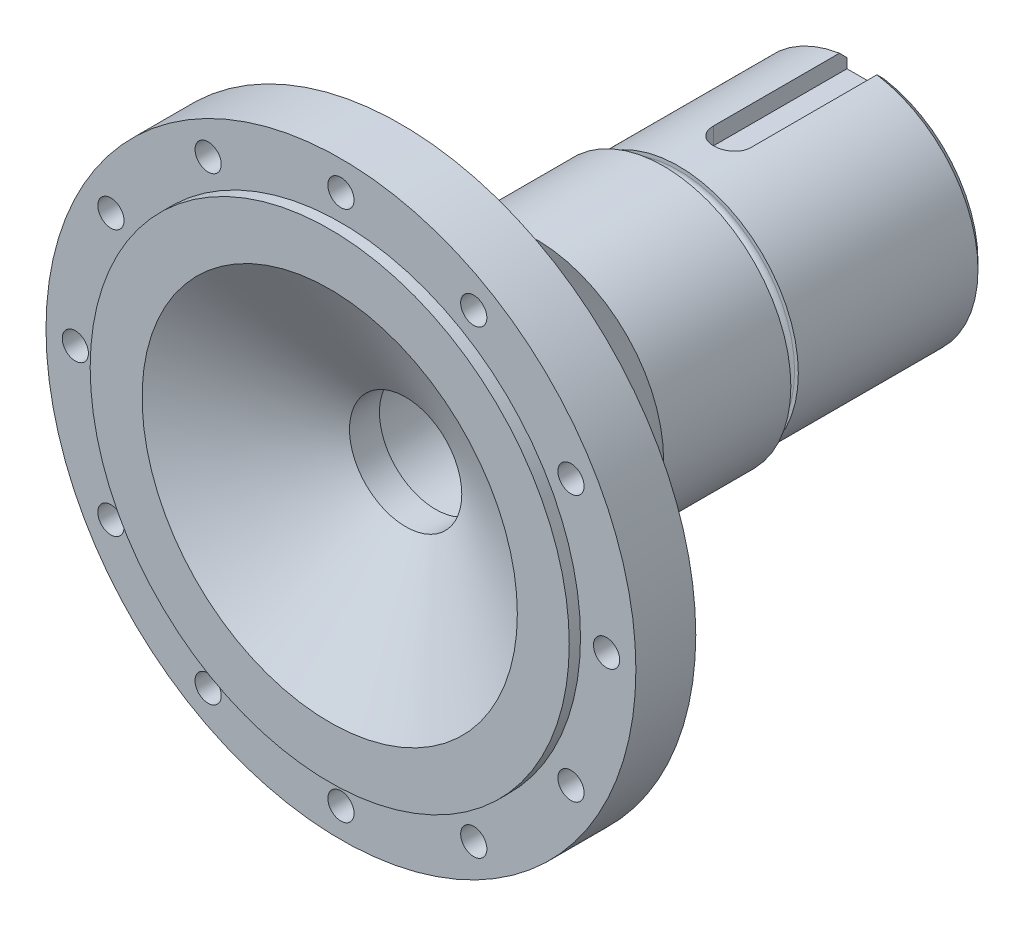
ISO-10303-21;
HEADER;
FILE_DESCRIPTION(('STEP AP214'),'2;1');
FILE_NAME('part.step','',(''),(''),'','','');
FILE_SCHEMA(('AUTOMOTIVE_DESIGN { 1 0 10303 214 1 1 1 1 }'));
ENDSEC;
DATA;
#1=APPLICATION_CONTEXT('core data for automotive mechanical design processes');
#2=APPLICATION_PROTOCOL_DEFINITION('international standard','automotive_design',2000,#1);
#3=PRODUCT_CONTEXT('',#1,'mechanical');
#4=PRODUCT('Part','Part','',(#3));
#5=PRODUCT_RELATED_PRODUCT_CATEGORY('part','',(#4));
#6=PRODUCT_DEFINITION_FORMATION('','',#4);
#7=PRODUCT_DEFINITION_CONTEXT('part definition',#1,'design');
#8=PRODUCT_DEFINITION('design','',#6,#7);
#9=PRODUCT_DEFINITION_SHAPE('','',#8);
#10=(LENGTH_UNIT() NAMED_UNIT(*) SI_UNIT(.MILLI.,.METRE.));
#11=(NAMED_UNIT(*) PLANE_ANGLE_UNIT() SI_UNIT($,.RADIAN.));
#12=(NAMED_UNIT(*) SI_UNIT($,.STERADIAN.) SOLID_ANGLE_UNIT());
#13=UNCERTAINTY_MEASURE_WITH_UNIT(LENGTH_MEASURE(1.E-05),#10,'distance_accuracy_value','');
#14=(GEOMETRIC_REPRESENTATION_CONTEXT(3) GLOBAL_UNCERTAINTY_ASSIGNED_CONTEXT((#13)) GLOBAL_UNIT_ASSIGNED_CONTEXT((#10,
#11,#12)) REPRESENTATION_CONTEXT('',''));
#15=CARTESIAN_POINT('',(0.,0.,0.));
#16=DIRECTION('',(0.,0.,1.));
#17=DIRECTION('',(1.,0.,0.));
#18=AXIS2_PLACEMENT_3D('',#15,#16,#17);
#19=CARTESIAN_POINT('',(0.,8.03891519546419,-72.3457304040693));
#20=DIRECTION('',(0.,0.,1.));
#21=DIRECTION('',(1.,0.,0.));
#22=AXIS2_PLACEMENT_3D('',#19,#20,#21);
#23=PLANE('',#22);
#24=CARTESIAN_POINT('',(0.,0.,-72.3457304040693));
#25=DIRECTION('',(0.,0.,1.));
#26=DIRECTION('',(1.,0.,0.));
#27=AXIS2_PLACEMENT_3D('',#24,#25,#26);
#28=CIRCLE('',#27,12.5);
#29=CARTESIAN_POINT('',(12.5,0.,-72.3457304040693));
#30=VERTEX_POINT('',#29);
#31=EDGE_CURVE('E167',#30,#30,#28,.T.);
#32=ORIENTED_EDGE('',*,*,#31,.T.);
#33=EDGE_LOOP('',(#32));
#34=FACE_BOUND('',#33,.T.);
#35=DIRECTION('',(0.,-1.,0.));
#36=VECTOR('',#35,1.);
#37=CARTESIAN_POINT('',(2.50000000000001,8.03891519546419,-72.3457304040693));
#38=LINE('',#37,#36);
#39=CARTESIAN_POINT('',(2.50000000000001,14.7901994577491,-72.3457304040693));
#40=VERTEX_POINT('',#39);
#41=CARTESIAN_POINT('',(2.50000000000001,13.5,-72.3457304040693));
#42=VERTEX_POINT('',#41);
#43=EDGE_CURVE('E93',#40,#42,#38,.T.);
#44=ORIENTED_EDGE('',*,*,#43,.F.);
#45=CARTESIAN_POINT('',(0.,0.,-72.3457304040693));
#46=DIRECTION('',(0.,0.,1.));
#47=DIRECTION('',(1.,0.,0.));
#48=AXIS2_PLACEMENT_3D('',#45,#46,#47);
#49=CIRCLE('',#48,15.);
#50=CARTESIAN_POINT('',(-2.50000000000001,14.7901994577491,-72.3457304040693));
#51=VERTEX_POINT('',#50);
#52=EDGE_CURVE('E40',#40,#51,#49,.F.);
#53=ORIENTED_EDGE('',*,*,#52,.T.);
#54=DIRECTION('',(0.,1.,0.));
#55=VECTOR('',#54,1.);
#56=CARTESIAN_POINT('',(-2.50000000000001,8.03891519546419,-72.3457304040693));
#57=LINE('',#56,#55);
#58=CARTESIAN_POINT('',(-2.50000000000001,13.5,-72.3457304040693));
#59=VERTEX_POINT('',#58);
#60=EDGE_CURVE('E87',#59,#51,#57,.T.);
#61=ORIENTED_EDGE('',*,*,#60,.F.);
#62=DIRECTION('',(-1.,0.,0.));
#63=VECTOR('',#62,1.);
#64=CARTESIAN_POINT('',(0.,13.5,-72.3457304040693));
#65=LINE('',#64,#63);
#66=EDGE_CURVE('E576',#42,#59,#65,.T.);
#67=ORIENTED_EDGE('',*,*,#66,.F.);
#68=EDGE_LOOP('',(#44,#53,#61,#67));
#69=FACE_BOUND('',#68,.T.);
#70=ADVANCED_FACE('F27',(#34,#69),#23,.F.);
#71=CARTESIAN_POINT('',(0.,0.,61.8175968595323));
#72=DIRECTION('',(0.,0.,1.));
#73=DIRECTION('',(1.,0.,0.));
#74=AXIS2_PLACEMENT_3D('',#71,#72,#73);
#75=CYLINDRICAL_SURFACE('',#74,16.);
#76=CARTESIAN_POINT('',(0.,0.,-47.3457304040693));
#77=DIRECTION('',(0.,0.,1.));
#78=DIRECTION('',(1.,0.,0.));
#79=AXIS2_PLACEMENT_3D('',#76,#77,#78);
#80=CIRCLE('',#79,16.);
#81=CARTESIAN_POINT('',(16.,0.,-47.3457304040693));
#82=VERTEX_POINT('',#81);
#83=EDGE_CURVE('E164',#82,#82,#80,.T.);
#84=ORIENTED_EDGE('',*,*,#83,.F.);
#85=EDGE_LOOP('',(#84));
#86=FACE_BOUND('',#85,.T.);
#87=DIRECTION('',(0.,0.,1.));
#88=VECTOR('',#87,1.);
#89=CARTESIAN_POINT('',(-2.50000000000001,15.8034806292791,61.8175968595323));
#90=LINE('',#89,#88);
#91=CARTESIAN_POINT('',(-2.50000000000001,15.8034806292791,-54.510874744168));
#92=VERTEX_POINT('',#91);
#93=CARTESIAN_POINT('',(-2.50000000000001,15.8034806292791,-71.3457304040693));
#94=VERTEX_POINT('',#93);
#95=EDGE_CURVE('E215',#92,#94,#90,.F.);
#96=ORIENTED_EDGE('',*,*,#95,.T.);
#97=CARTESIAN_POINT('',(0.,0.,-71.3457304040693));
#98=DIRECTION('',(0.,0.,1.));
#99=DIRECTION('',(1.,0.,0.));
#100=AXIS2_PLACEMENT_3D('',#97,#98,#99);
#101=CIRCLE('',#100,16.);
#102=CARTESIAN_POINT('',(2.50000000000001,15.8034806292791,-71.3457304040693));
#103=VERTEX_POINT('',#102);
#104=EDGE_CURVE('E574',#94,#103,#101,.T.);
#105=ORIENTED_EDGE('',*,*,#104,.T.);
#106=DIRECTION('',(0.,0.,1.));
#107=VECTOR('',#106,1.);
#108=CARTESIAN_POINT('',(2.50000000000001,15.8034806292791,61.8175968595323));
#109=LINE('',#108,#107);
#110=CARTESIAN_POINT('',(2.50000000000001,15.8034806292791,-54.510874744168));
#111=VERTEX_POINT('',#110);
#112=EDGE_CURVE('E248',#103,#111,#109,.T.);
#113=ORIENTED_EDGE('',*,*,#112,.T.);
#114=CARTESIAN_POINT('',(2.50000000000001,15.8034806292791,-54.510874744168));
#115=CARTESIAN_POINT('',(2.5000072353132,15.80347600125,-54.4410171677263));
#116=CARTESIAN_POINT('',(2.49707201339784,15.8039437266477,-54.3711633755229));
#117=CARTESIAN_POINT('',(2.48537272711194,15.8057896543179,-54.2319640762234));
#118=CARTESIAN_POINT('',(2.47660920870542,15.8071677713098,-54.1626185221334));
#119=CARTESIAN_POINT('',(2.45332339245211,15.8107980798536,-54.0250059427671));
#120=CARTESIAN_POINT('',(2.4388080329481,15.813049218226,-53.9567377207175));
#121=CARTESIAN_POINT('',(2.40414286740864,15.8183564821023,-53.8216990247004));
#122=CARTESIAN_POINT('',(2.38399307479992,15.8214126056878,-53.7549285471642));
#123=CARTESIAN_POINT('',(2.31527776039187,15.831666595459,-53.557534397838));
#124=CARTESIAN_POINT('',(2.25843113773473,15.8399525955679,-53.4297390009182));
#125=CARTESIAN_POINT('',(2.12438158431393,15.8584851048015,-53.1855706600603));
#126=CARTESIAN_POINT('',(2.04717889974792,15.8687315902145,-53.0691975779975));
#127=CARTESIAN_POINT('',(1.87388294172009,15.8901297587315,-52.8500891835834));
#128=CARTESIAN_POINT('',(1.77764958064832,15.9012877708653,-52.7474650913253));
#129=CARTESIAN_POINT('',(1.56932125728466,15.9231962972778,-52.5597472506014));
#130=CARTESIAN_POINT('',(1.45722387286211,15.9339467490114,-52.4746561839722));
#131=CARTESIAN_POINT('',(1.21963095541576,15.9538949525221,-52.3240080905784));
#132=CARTESIAN_POINT('',(1.09406870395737,15.9630843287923,-52.2585550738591));
#133=CARTESIAN_POINT('',(0.833572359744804,15.978803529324,-52.149714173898));
#134=CARTESIAN_POINT('',(0.698639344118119,15.9853336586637,-52.1063237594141));
#135=CARTESIAN_POINT('',(0.424386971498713,15.9949542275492,-52.0431764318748));
#136=CARTESIAN_POINT('',(0.285112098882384,15.9980721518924,-52.0232305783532));
#137=CARTESIAN_POINT('',(0.00515650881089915,16.0006113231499,-52.0069516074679));
#138=CARTESIAN_POINT('',(-0.135524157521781,16.0000327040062,-52.0106176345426));
#139=CARTESIAN_POINT('',(-0.413000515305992,15.9952657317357,-52.0413107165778));
#140=CARTESIAN_POINT('',(-0.549819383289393,15.9911088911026,-52.0681338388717));
#141=CARTESIAN_POINT('',(-0.816989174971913,15.9796876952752,-52.1440590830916));
#142=CARTESIAN_POINT('',(-0.947339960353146,15.9724232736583,-52.1931616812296));
#143=CARTESIAN_POINT('',(-1.19848985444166,15.9555490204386,-52.3124595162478));
#144=CARTESIAN_POINT('',(-1.31924765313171,15.9459297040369,-52.3827403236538));
#145=CARTESIAN_POINT('',(-1.54732802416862,15.9254170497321,-52.5423344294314));
#146=CARTESIAN_POINT('',(-1.6546501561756,15.9145236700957,-52.6316483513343));
#147=CARTESIAN_POINT('',(-1.85400788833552,15.8925403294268,-52.8278938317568));
#148=CARTESIAN_POINT('',(-1.94587033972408,15.8814495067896,-52.9350012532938));
#149=CARTESIAN_POINT('',(-2.11037188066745,15.8604297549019,-53.1632402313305));
#150=CARTESIAN_POINT('',(-2.18300543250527,15.850501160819,-53.2843758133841));
#151=CARTESIAN_POINT('',(-2.30701457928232,15.8329285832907,-53.5374372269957));
#152=CARTESIAN_POINT('',(-2.35835878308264,15.82528797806,-53.6693786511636));
#153=CARTESIAN_POINT('',(-2.43803542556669,15.8132107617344,-53.9400667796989));
#154=CARTESIAN_POINT('',(-2.46640232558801,15.8087693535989,-54.0788029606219));
#155=CARTESIAN_POINT('',(-2.48858763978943,15.8052822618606,-54.2672947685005));
#156=CARTESIAN_POINT('',(-2.4928691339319,15.8046072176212,-54.3159530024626));
#157=CARTESIAN_POINT('',(-2.49857155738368,15.8037068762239,-54.4133587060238));
#158=CARTESIAN_POINT('',(-2.49999729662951,15.8034808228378,-54.4621058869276));
#159=CARTESIAN_POINT('',(-2.50000000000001,15.8034806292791,-54.510874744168));
#160=B_SPLINE_CURVE_WITH_KNOTS('',3,(#114,#115,#116,#117,#118,#119,#120,#121,#122,#123,#124,
#125,#126,#127,#128,#129,#130,#131,#132,#133,#134,#135,#136,#137,#138,#139,#140,#141,#142,#143,
#144,#145,#146,#147,#148,#149,#150,#151,#152,#153,#154,#155,#156,#157,#158,#159),.UNSPECIFIED.,
.F.,.F.,(4,2,2,2,2,2,2,2,2,2,2,2,2,2,2,2,2,2,2,2,2,2,4),(0.,0.209502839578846,0.41898605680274,
0.628217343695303,0.837448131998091,1.25564214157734,1.67383109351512,2.09522137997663,
2.51667607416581,2.94032506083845,3.36392543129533,3.78408806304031,4.20423547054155,
4.62072016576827,5.0372137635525,5.45541329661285,5.87362653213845,6.29625026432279,
6.71899557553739,7.14236202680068,7.56509233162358,7.71158120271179,7.85782313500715),.UNSPECIFIED.);
#161=EDGE_CURVE('E86',#111,#92,#160,.T.);
#162=ORIENTED_EDGE('',*,*,#161,.T.);
#163=EDGE_LOOP('',(#96,#105,#113,#162));
#164=FACE_BOUND('',#163,.T.);
#165=ADVANCED_FACE('F250',(#86,#164),#75,.T.);
#166=CARTESIAN_POINT('',(0.,0.,61.8175968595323));
#167=DIRECTION('',(0.,0.,1.));
#168=DIRECTION('',(1.,0.,0.));
#169=AXIS2_PLACEMENT_3D('',#166,#167,#168);
#170=CYLINDRICAL_SURFACE('',#169,17.);
#171=CARTESIAN_POINT('',(0.,0.,-45.3457304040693));
#172=DIRECTION('',(0.,0.,1.));
#173=DIRECTION('',(1.,0.,0.));
#174=AXIS2_PLACEMENT_3D('',#171,#172,#173);
#175=CIRCLE('',#174,17.);
#176=CARTESIAN_POINT('',(17.,0.,-45.3457304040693));
#177=VERTEX_POINT('',#176);
#178=EDGE_CURVE('E155',#177,#177,#175,.T.);
#179=ORIENTED_EDGE('',*,*,#178,.T.);
#180=EDGE_LOOP('',(#179));
#181=FACE_BOUND('',#180,.T.);
#182=CARTESIAN_POINT('',(0.,0.,-28.3457304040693));
#183=DIRECTION('',(0.,0.,1.));
#184=DIRECTION('',(1.,0.,0.));
#185=AXIS2_PLACEMENT_3D('',#182,#183,#184);
#186=CIRCLE('',#185,17.);
#187=CARTESIAN_POINT('',(17.,0.,-28.3457304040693));
#188=VERTEX_POINT('',#187);
#189=EDGE_CURVE('E212',#188,#188,#186,.T.);
#190=ORIENTED_EDGE('',*,*,#189,.F.);
#191=EDGE_LOOP('',(#190));
#192=FACE_BOUND('',#191,.T.);
#193=ADVANCED_FACE('F29',(#181,#192),#170,.T.);
#194=CARTESIAN_POINT('',(0.,0.,-16.7457304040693));
#195=DIRECTION('',(0.,0.,1.));
#196=DIRECTION('',(1.,0.,0.));
#197=AXIS2_PLACEMENT_3D('',#194,#195,#196);
#198=CONICAL_SURFACE('',#197,26.7335557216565,0.698131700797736);
#199=ORIENTED_EDGE('',*,*,#189,.T.);
#200=EDGE_LOOP('',(#199));
#201=FACE_BOUND('',#200,.T.);
#202=CARTESIAN_POINT('',(0.,0.,-16.7457304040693));
#203=DIRECTION('',(0.,0.,1.));
#204=DIRECTION('',(1.,0.,0.));
#205=AXIS2_PLACEMENT_3D('',#202,#203,#204);
#206=CIRCLE('',#205,26.7335557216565);
#207=CARTESIAN_POINT('',(26.7335557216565,0.,-16.7457304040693));
#208=VERTEX_POINT('',#207);
#209=EDGE_CURVE('E209',#208,#208,#206,.T.);
#210=ORIENTED_EDGE('',*,*,#209,.F.);
#211=EDGE_LOOP('',(#210));
#212=FACE_BOUND('',#211,.T.);
#213=ADVANCED_FACE('F383',(#201,#212),#198,.T.);
#214=CARTESIAN_POINT('',(0.,8.03891519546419,-16.7457304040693));
#215=DIRECTION('',(0.,0.,1.));
#216=DIRECTION('',(1.,0.,0.));
#217=AXIS2_PLACEMENT_3D('',#214,#215,#216);
#218=PLANE('',#217);
#219=CARTESIAN_POINT('',(0.,0.,-16.7457304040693));
#220=DIRECTION('',(0.,0.,1.));
#221=DIRECTION('',(1.,0.,0.));
#222=AXIS2_PLACEMENT_3D('',#219,#220,#221);
#223=CIRCLE('',#222,28.);
#224=CARTESIAN_POINT('',(28.,0.,-16.7457304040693));
#225=VERTEX_POINT('',#224);
#226=EDGE_CURVE('E206',#225,#225,#223,.T.);
#227=ORIENTED_EDGE('',*,*,#226,.F.);
#228=EDGE_LOOP('',(#227));
#229=FACE_BOUND('',#228,.T.);
#230=ORIENTED_EDGE('',*,*,#209,.T.);
#231=EDGE_LOOP('',(#230));
#232=FACE_BOUND('',#231,.T.);
#233=ADVANCED_FACE('F380',(#229,#232),#218,.F.);
#234=CARTESIAN_POINT('',(0.,0.,61.8175968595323));
#235=DIRECTION('',(0.,0.,1.));
#236=DIRECTION('',(1.,0.,0.));
#237=AXIS2_PLACEMENT_3D('',#234,#235,#236);
#238=CYLINDRICAL_SURFACE('',#237,28.);
#239=ORIENTED_EDGE('',*,*,#226,.T.);
#240=EDGE_LOOP('',(#239));
#241=FACE_BOUND('',#240,.T.);
#242=CARTESIAN_POINT('',(0.,0.,-10.2457304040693));
#243=DIRECTION('',(0.,0.,1.));
#244=DIRECTION('',(1.,0.,0.));
#245=AXIS2_PLACEMENT_3D('',#242,#243,#244);
#246=CIRCLE('',#245,28.);
#247=CARTESIAN_POINT('',(28.,0.,-10.2457304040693));
#248=VERTEX_POINT('',#247);
#249=EDGE_CURVE('E203',#248,#248,#246,.T.);
#250=ORIENTED_EDGE('',*,*,#249,.F.);
#251=EDGE_LOOP('',(#250));
#252=FACE_BOUND('',#251,.T.);
#253=ADVANCED_FACE('F376',(#241,#252),#238,.T.);
#254=CARTESIAN_POINT('',(0.,8.03891519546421,-10.2457304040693));
#255=DIRECTION('',(0.,0.,-1.));
#256=DIRECTION('',(-1.,0.,0.));
#257=AXIS2_PLACEMENT_3D('',#254,#255,#256);
#258=PLANE('',#257);
#259=CARTESIAN_POINT('',(17.741269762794,30.7287806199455,-10.2457304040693));
#260=DIRECTION('',(0.,0.,-1.));
#261=DIRECTION('',(-1.,0.,0.));
#262=AXIS2_PLACEMENT_3D('',#259,#260,#261);
#263=CIRCLE('',#262,1.75);
#264=CARTESIAN_POINT('',(15.991269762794,30.7287806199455,-10.2457304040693));
#265=VERTEX_POINT('',#264);
#266=EDGE_CURVE('E108',#265,#265,#263,.T.);
#267=ORIENTED_EDGE('',*,*,#266,.F.);
#268=EDGE_LOOP('',(#267));
#269=FACE_BOUND('',#268,.T.);
#270=CARTESIAN_POINT('',(30.7287806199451,17.7412697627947,-10.2457304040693));
#271=DIRECTION('',(0.,0.,-1.));
#272=DIRECTION('',(-1.,0.,0.));
#273=AXIS2_PLACEMENT_3D('',#270,#271,#272);
#274=CIRCLE('',#273,1.75);
#275=CARTESIAN_POINT('',(28.9787806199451,17.7412697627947,-10.2457304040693));
#276=VERTEX_POINT('',#275);
#277=EDGE_CURVE('E112',#276,#276,#274,.T.);
#278=ORIENTED_EDGE('',*,*,#277,.F.);
#279=EDGE_LOOP('',(#278));
#280=FACE_BOUND('',#279,.T.);
#281=CARTESIAN_POINT('',(35.4825395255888,3.71660089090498E-13,-10.2457304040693));
#282=DIRECTION('',(0.,0.,-1.));
#283=DIRECTION('',(-1.,0.,0.));
#284=AXIS2_PLACEMENT_3D('',#281,#282,#283);
#285=CIRCLE('',#284,1.75);
#286=CARTESIAN_POINT('',(33.7325395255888,3.71660089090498E-13,-10.2457304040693));
#287=VERTEX_POINT('',#286);
#288=EDGE_CURVE('E116',#287,#287,#285,.T.);
#289=ORIENTED_EDGE('',*,*,#288,.F.);
#290=EDGE_LOOP('',(#289));
#291=FACE_BOUND('',#290,.T.);
#292=CARTESIAN_POINT('',(30.7287806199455,-17.7412697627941,-10.2457304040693));
#293=DIRECTION('',(0.,0.,-1.));
#294=DIRECTION('',(-1.,0.,0.));
#295=AXIS2_PLACEMENT_3D('',#292,#293,#294);
#296=CIRCLE('',#295,1.75);
#297=CARTESIAN_POINT('',(28.9787806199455,-17.7412697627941,-10.2457304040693));
#298=VERTEX_POINT('',#297);
#299=EDGE_CURVE('E120',#298,#298,#296,.T.);
#300=ORIENTED_EDGE('',*,*,#299,.F.);
#301=EDGE_LOOP('',(#300));
#302=FACE_BOUND('',#301,.T.);
#303=CARTESIAN_POINT('',(17.7412697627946,-30.7287806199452,-10.2457304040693));
#304=DIRECTION('',(0.,0.,-1.));
#305=DIRECTION('',(-1.,0.,0.));
#306=AXIS2_PLACEMENT_3D('',#303,#304,#305);
#307=CIRCLE('',#306,1.75);
#308=CARTESIAN_POINT('',(15.9912697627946,-30.7287806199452,-10.2457304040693));
#309=VERTEX_POINT('',#308);
#310=EDGE_CURVE('E124',#309,#309,#307,.T.);
#311=ORIENTED_EDGE('',*,*,#310,.F.);
#312=EDGE_LOOP('',(#311));
#313=FACE_BOUND('',#312,.T.);
#314=CARTESIAN_POINT('',(2.47773392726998E-13,-35.4825395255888,-10.2457304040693));
#315=DIRECTION('',(0.,0.,-1.));
#316=DIRECTION('',(-1.,0.,0.));
#317=AXIS2_PLACEMENT_3D('',#314,#315,#316);
#318=CIRCLE('',#317,1.75);
#319=CARTESIAN_POINT('',(-1.74999999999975,-35.4825395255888,-10.2457304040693));
#320=VERTEX_POINT('',#319);
#321=EDGE_CURVE('E128',#320,#320,#318,.T.);
#322=ORIENTED_EDGE('',*,*,#321,.F.);
#323=EDGE_LOOP('',(#322));
#324=FACE_BOUND('',#323,.T.);
#325=CARTESIAN_POINT('',(-17.7412697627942,-30.7287806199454,-10.2457304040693));
#326=DIRECTION('',(0.,0.,-1.));
#327=DIRECTION('',(-1.,0.,0.));
#328=AXIS2_PLACEMENT_3D('',#325,#326,#327);
#329=CIRCLE('',#328,1.75);
#330=CARTESIAN_POINT('',(-19.4912697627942,-30.7287806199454,-10.2457304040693));
#331=VERTEX_POINT('',#330);
#332=EDGE_CURVE('E132',#331,#331,#329,.T.);
#333=ORIENTED_EDGE('',*,*,#332,.F.);
#334=EDGE_LOOP('',(#333));
#335=FACE_BOUND('',#334,.T.);
#336=CARTESIAN_POINT('',(-30.7287806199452,-17.7412697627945,-10.2457304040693));
#337=DIRECTION('',(0.,0.,-1.));
#338=DIRECTION('',(-1.,0.,0.));
#339=AXIS2_PLACEMENT_3D('',#336,#337,#338);
#340=CIRCLE('',#339,1.75);
#341=CARTESIAN_POINT('',(-32.4787806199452,-17.7412697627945,-10.2457304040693));
#342=VERTEX_POINT('',#341);
#343=EDGE_CURVE('E136',#342,#342,#340,.T.);
#344=ORIENTED_EDGE('',*,*,#343,.F.);
#345=EDGE_LOOP('',(#344));
#346=FACE_BOUND('',#345,.T.);
#347=CARTESIAN_POINT('',(-35.4825395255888,-1.23886696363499E-13,-10.2457304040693));
#348=DIRECTION('',(0.,0.,-1.));
#349=DIRECTION('',(-1.,0.,0.));
#350=AXIS2_PLACEMENT_3D('',#347,#348,#349);
#351=CIRCLE('',#350,1.75);
#352=CARTESIAN_POINT('',(-37.2325395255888,-1.23886696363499E-13,-10.2457304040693));
#353=VERTEX_POINT('',#352);
#354=EDGE_CURVE('E140',#353,#353,#351,.T.);
#355=ORIENTED_EDGE('',*,*,#354,.F.);
#356=EDGE_LOOP('',(#355));
#357=FACE_BOUND('',#356,.T.);
#358=CARTESIAN_POINT('',(-30.7287806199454,17.7412697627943,-10.2457304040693));
#359=DIRECTION('',(0.,0.,-1.));
#360=DIRECTION('',(-1.,0.,0.));
#361=AXIS2_PLACEMENT_3D('',#358,#359,#360);
#362=CIRCLE('',#361,1.75);
#363=CARTESIAN_POINT('',(-32.4787806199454,17.7412697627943,-10.2457304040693));
#364=VERTEX_POINT('',#363);
#365=EDGE_CURVE('E144',#364,#364,#362,.T.);
#366=ORIENTED_EDGE('',*,*,#365,.F.);
#367=EDGE_LOOP('',(#366));
#368=FACE_BOUND('',#367,.T.);
#369=CARTESIAN_POINT('',(-17.7412697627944,30.7287806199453,-10.2457304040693));
#370=DIRECTION('',(0.,0.,-1.));
#371=DIRECTION('',(-1.,0.,0.));
#372=AXIS2_PLACEMENT_3D('',#369,#370,#371);
#373=CIRCLE('',#372,1.75);
#374=CARTESIAN_POINT('',(-19.4912697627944,30.7287806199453,-10.2457304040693));
#375=VERTEX_POINT('',#374);
#376=EDGE_CURVE('E148',#375,#375,#373,.T.);
#377=ORIENTED_EDGE('',*,*,#376,.F.);
#378=EDGE_LOOP('',(#377));
#379=FACE_BOUND('',#378,.T.);
#380=CARTESIAN_POINT('',(0.,35.4825395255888,-10.2457304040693));
#381=DIRECTION('',(0.,0.,-1.));
#382=DIRECTION('',(-1.,0.,0.));
#383=AXIS2_PLACEMENT_3D('',#380,#381,#382);
#384=CIRCLE('',#383,1.75);
#385=CARTESIAN_POINT('',(-1.75,35.4825395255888,-10.2457304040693));
#386=VERTEX_POINT('',#385);
#387=EDGE_CURVE('E152',#386,#386,#384,.T.);
#388=ORIENTED_EDGE('',*,*,#387,.F.);
#389=EDGE_LOOP('',(#388));
#390=FACE_BOUND('',#389,.T.);
#391=ORIENTED_EDGE('',*,*,#249,.T.);
#392=EDGE_LOOP('',(#391));
#393=FACE_BOUND('',#392,.T.);
#394=CARTESIAN_POINT('',(0.,0.,-10.2457304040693));
#395=DIRECTION('',(0.,0.,1.));
#396=DIRECTION('',(1.,0.,0.));
#397=AXIS2_PLACEMENT_3D('',#394,#395,#396);
#398=CIRCLE('',#397,39.4);
#399=CARTESIAN_POINT('',(39.4,0.,-10.2457304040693));
#400=VERTEX_POINT('',#399);
#401=EDGE_CURVE('E200',#400,#400,#398,.T.);
#402=ORIENTED_EDGE('',*,*,#401,.F.);
#403=EDGE_LOOP('',(#402));
#404=FACE_BOUND('',#403,.T.);
#405=ADVANCED_FACE('F372',(#269,#280,#291,#302,#313,#324,#335,#346,#357,#368,#379,#390,#393,
#404),#258,.T.);
#406=CARTESIAN_POINT('',(0.,0.,61.8175968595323));
#407=DIRECTION('',(0.,0.,1.));
#408=DIRECTION('',(1.,0.,0.));
#409=AXIS2_PLACEMENT_3D('',#406,#407,#408);
#410=CYLINDRICAL_SURFACE('',#409,39.4);
#411=ORIENTED_EDGE('',*,*,#401,.T.);
#412=EDGE_LOOP('',(#411));
#413=FACE_BOUND('',#412,.T.);
#414=CARTESIAN_POINT('',(0.,0.,-2.2457304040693));
#415=DIRECTION('',(0.,0.,1.));
#416=DIRECTION('',(1.,0.,0.));
#417=AXIS2_PLACEMENT_3D('',#414,#415,#416);
#418=CIRCLE('',#417,39.4);
#419=CARTESIAN_POINT('',(39.4,0.,-2.2457304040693));
#420=VERTEX_POINT('',#419);
#421=EDGE_CURVE('E197',#420,#420,#418,.T.);
#422=ORIENTED_EDGE('',*,*,#421,.F.);
#423=EDGE_LOOP('',(#422));
#424=FACE_BOUND('',#423,.T.);
#425=ADVANCED_FACE('F368',(#413,#424),#410,.T.);
#426=CARTESIAN_POINT('',(0.,8.03891519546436,-2.2457304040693));
#427=DIRECTION('',(0.,0.,1.));
#428=DIRECTION('',(1.,0.,0.));
#429=AXIS2_PLACEMENT_3D('',#426,#427,#428);
#430=PLANE('',#429);
#431=CARTESIAN_POINT('',(17.741269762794,30.7287806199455,-2.24573040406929));
#432=DIRECTION('',(0.,0.,1.));
#433=DIRECTION('',(1.,0.,0.));
#434=AXIS2_PLACEMENT_3D('',#431,#432,#433);
#435=CIRCLE('',#434,1.75);
#436=CARTESIAN_POINT('',(19.491269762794,30.7287806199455,-2.24573040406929));
#437=VERTEX_POINT('',#436);
#438=EDGE_CURVE('E107',#437,#437,#435,.T.);
#439=ORIENTED_EDGE('',*,*,#438,.F.);
#440=EDGE_LOOP('',(#439));
#441=FACE_BOUND('',#440,.T.);
#442=CARTESIAN_POINT('',(30.7287806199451,17.7412697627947,-2.24573040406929));
#443=DIRECTION('',(0.,0.,1.));
#444=DIRECTION('',(1.,0.,0.));
#445=AXIS2_PLACEMENT_3D('',#442,#443,#444);
#446=CIRCLE('',#445,1.75);
#447=CARTESIAN_POINT('',(32.4787806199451,17.7412697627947,-2.24573040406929));
#448=VERTEX_POINT('',#447);
#449=EDGE_CURVE('E111',#448,#448,#446,.T.);
#450=ORIENTED_EDGE('',*,*,#449,.F.);
#451=EDGE_LOOP('',(#450));
#452=FACE_BOUND('',#451,.T.);
#453=CARTESIAN_POINT('',(35.4825395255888,3.71660089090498E-13,-2.24573040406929));
#454=DIRECTION('',(0.,0.,1.));
#455=DIRECTION('',(1.,0.,0.));
#456=AXIS2_PLACEMENT_3D('',#453,#454,#455);
#457=CIRCLE('',#456,1.75);
#458=CARTESIAN_POINT('',(37.2325395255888,3.71660089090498E-13,-2.24573040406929));
#459=VERTEX_POINT('',#458);
#460=EDGE_CURVE('E115',#459,#459,#457,.T.);
#461=ORIENTED_EDGE('',*,*,#460,.F.);
#462=EDGE_LOOP('',(#461));
#463=FACE_BOUND('',#462,.T.);
#464=CARTESIAN_POINT('',(30.7287806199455,-17.7412697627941,-2.24573040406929));
#465=DIRECTION('',(0.,0.,1.));
#466=DIRECTION('',(1.,0.,0.));
#467=AXIS2_PLACEMENT_3D('',#464,#465,#466);
#468=CIRCLE('',#467,1.75);
#469=CARTESIAN_POINT('',(32.4787806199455,-17.7412697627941,-2.24573040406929));
#470=VERTEX_POINT('',#469);
#471=EDGE_CURVE('E119',#470,#470,#468,.T.);
#472=ORIENTED_EDGE('',*,*,#471,.F.);
#473=EDGE_LOOP('',(#472));
#474=FACE_BOUND('',#473,.T.);
#475=CARTESIAN_POINT('',(17.7412697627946,-30.7287806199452,-2.24573040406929));
#476=DIRECTION('',(0.,0.,1.));
#477=DIRECTION('',(1.,0.,0.));
#478=AXIS2_PLACEMENT_3D('',#475,#476,#477);
#479=CIRCLE('',#478,1.75);
#480=CARTESIAN_POINT('',(19.4912697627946,-30.7287806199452,-2.24573040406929));
#481=VERTEX_POINT('',#480);
#482=EDGE_CURVE('E123',#481,#481,#479,.T.);
#483=ORIENTED_EDGE('',*,*,#482,.F.);
#484=EDGE_LOOP('',(#483));
#485=FACE_BOUND('',#484,.T.);
#486=CARTESIAN_POINT('',(2.47773392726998E-13,-35.4825395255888,-2.24573040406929));
#487=DIRECTION('',(0.,0.,1.));
#488=DIRECTION('',(1.,0.,0.));
#489=AXIS2_PLACEMENT_3D('',#486,#487,#488);
#490=CIRCLE('',#489,1.75);
#491=CARTESIAN_POINT('',(1.75000000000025,-35.4825395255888,-2.24573040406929));
#492=VERTEX_POINT('',#491);
#493=EDGE_CURVE('E127',#492,#492,#490,.T.);
#494=ORIENTED_EDGE('',*,*,#493,.F.);
#495=EDGE_LOOP('',(#494));
#496=FACE_BOUND('',#495,.T.);
#497=CARTESIAN_POINT('',(-17.7412697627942,-30.7287806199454,-2.24573040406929));
#498=DIRECTION('',(0.,0.,1.));
#499=DIRECTION('',(1.,0.,0.));
#500=AXIS2_PLACEMENT_3D('',#497,#498,#499);
#501=CIRCLE('',#500,1.75);
#502=CARTESIAN_POINT('',(-15.9912697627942,-30.7287806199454,-2.24573040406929));
#503=VERTEX_POINT('',#502);
#504=EDGE_CURVE('E131',#503,#503,#501,.T.);
#505=ORIENTED_EDGE('',*,*,#504,.F.);
#506=EDGE_LOOP('',(#505));
#507=FACE_BOUND('',#506,.T.);
#508=CARTESIAN_POINT('',(-30.7287806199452,-17.7412697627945,-2.24573040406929));
#509=DIRECTION('',(0.,0.,1.));
#510=DIRECTION('',(1.,0.,0.));
#511=AXIS2_PLACEMENT_3D('',#508,#509,#510);
#512=CIRCLE('',#511,1.75);
#513=CARTESIAN_POINT('',(-28.9787806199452,-17.7412697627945,-2.24573040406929));
#514=VERTEX_POINT('',#513);
#515=EDGE_CURVE('E135',#514,#514,#512,.T.);
#516=ORIENTED_EDGE('',*,*,#515,.F.);
#517=EDGE_LOOP('',(#516));
#518=FACE_BOUND('',#517,.T.);
#519=CARTESIAN_POINT('',(-35.4825395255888,-1.23886696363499E-13,-2.24573040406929));
#520=DIRECTION('',(0.,0.,1.));
#521=DIRECTION('',(1.,0.,0.));
#522=AXIS2_PLACEMENT_3D('',#519,#520,#521);
#523=CIRCLE('',#522,1.75);
#524=CARTESIAN_POINT('',(-33.7325395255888,-1.23886696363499E-13,-2.24573040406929));
#525=VERTEX_POINT('',#524);
#526=EDGE_CURVE('E139',#525,#525,#523,.T.);
#527=ORIENTED_EDGE('',*,*,#526,.F.);
#528=EDGE_LOOP('',(#527));
#529=FACE_BOUND('',#528,.T.);
#530=CARTESIAN_POINT('',(-30.7287806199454,17.7412697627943,-2.24573040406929));
#531=DIRECTION('',(0.,0.,1.));
#532=DIRECTION('',(1.,0.,0.));
#533=AXIS2_PLACEMENT_3D('',#530,#531,#532);
#534=CIRCLE('',#533,1.75);
#535=CARTESIAN_POINT('',(-28.9787806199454,17.7412697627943,-2.24573040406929));
#536=VERTEX_POINT('',#535);
#537=EDGE_CURVE('E143',#536,#536,#534,.T.);
#538=ORIENTED_EDGE('',*,*,#537,.F.);
#539=EDGE_LOOP('',(#538));
#540=FACE_BOUND('',#539,.T.);
#541=CARTESIAN_POINT('',(-17.7412697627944,30.7287806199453,-2.24573040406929));
#542=DIRECTION('',(0.,0.,1.));
#543=DIRECTION('',(1.,0.,0.));
#544=AXIS2_PLACEMENT_3D('',#541,#542,#543);
#545=CIRCLE('',#544,1.75);
#546=CARTESIAN_POINT('',(-15.9912697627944,30.7287806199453,-2.24573040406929));
#547=VERTEX_POINT('',#546);
#548=EDGE_CURVE('E147',#547,#547,#545,.T.);
#549=ORIENTED_EDGE('',*,*,#548,.F.);
#550=EDGE_LOOP('',(#549));
#551=FACE_BOUND('',#550,.T.);
#552=CARTESIAN_POINT('',(0.,35.4825395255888,-2.24573040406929));
#553=DIRECTION('',(0.,0.,1.));
#554=DIRECTION('',(1.,0.,0.));
#555=AXIS2_PLACEMENT_3D('',#552,#553,#554);
#556=CIRCLE('',#555,1.75);
#557=CARTESIAN_POINT('',(1.75,35.4825395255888,-2.24573040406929));
#558=VERTEX_POINT('',#557);
#559=EDGE_CURVE('E151',#558,#558,#556,.T.);
#560=ORIENTED_EDGE('',*,*,#559,.F.);
#561=EDGE_LOOP('',(#560));
#562=FACE_BOUND('',#561,.T.);
#563=ORIENTED_EDGE('',*,*,#421,.T.);
#564=EDGE_LOOP('',(#563));
#565=FACE_BOUND('',#564,.T.);
#566=CARTESIAN_POINT('',(0.,0.,-2.24573040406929));
#567=DIRECTION('',(0.,0.,1.));
#568=DIRECTION('',(1.,0.,0.));
#569=AXIS2_PLACEMENT_3D('',#566,#567,#568);
#570=CIRCLE('',#569,32.);
#571=CARTESIAN_POINT('',(32.,0.,-2.24573040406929));
#572=VERTEX_POINT('',#571);
#573=EDGE_CURVE('E194',#572,#572,#570,.T.);
#574=ORIENTED_EDGE('',*,*,#573,.F.);
#575=EDGE_LOOP('',(#574));
#576=FACE_BOUND('',#575,.T.);
#577=ADVANCED_FACE('F364',(#441,#452,#463,#474,#485,#496,#507,#518,#529,#540,#551,#562,#565,
#576),#430,.T.);
#578=CARTESIAN_POINT('',(0.,0.,61.8175968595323));
#579=DIRECTION('',(0.,0.,1.));
#580=DIRECTION('',(1.,0.,0.));
#581=AXIS2_PLACEMENT_3D('',#578,#579,#580);
#582=CYLINDRICAL_SURFACE('',#581,32.);
#583=CARTESIAN_POINT('',(0.,0.,-0.745730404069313));
#584=DIRECTION('',(0.,0.,1.));
#585=DIRECTION('',(1.,0.,0.));
#586=AXIS2_PLACEMENT_3D('',#583,#584,#585);
#587=CIRCLE('',#586,32.);
#588=CARTESIAN_POINT('',(32.,0.,-0.745730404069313));
#589=VERTEX_POINT('',#588);
#590=EDGE_CURVE('E191',#589,#589,#587,.T.);
#591=ORIENTED_EDGE('',*,*,#590,.F.);
#592=EDGE_LOOP('',(#591));
#593=FACE_BOUND('',#592,.T.);
#594=ORIENTED_EDGE('',*,*,#573,.T.);
#595=EDGE_LOOP('',(#594));
#596=FACE_BOUND('',#595,.T.);
#597=ADVANCED_FACE('F360',(#593,#596),#582,.T.);
#598=CARTESIAN_POINT('',(0.,8.0389151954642,-0.74573040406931));
#599=DIRECTION('',(0.,0.,-1.));
#600=DIRECTION('',(-1.,0.,0.));
#601=AXIS2_PLACEMENT_3D('',#598,#599,#600);
#602=PLANE('',#601);
#603=CARTESIAN_POINT('',(0.,0.,-0.745730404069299));
#604=DIRECTION('',(0.,0.,1.));
#605=DIRECTION('',(1.,0.,0.));
#606=AXIS2_PLACEMENT_3D('',#603,#604,#605);
#607=CIRCLE('',#606,25.0652496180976);
#608=CARTESIAN_POINT('',(25.0652496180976,0.,-0.745730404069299));
#609=VERTEX_POINT('',#608);
#610=EDGE_CURVE('E188',#609,#609,#607,.T.);
#611=ORIENTED_EDGE('',*,*,#610,.F.);
#612=EDGE_LOOP('',(#611));
#613=FACE_BOUND('',#612,.T.);
#614=ORIENTED_EDGE('',*,*,#590,.T.);
#615=EDGE_LOOP('',(#614));
#616=FACE_BOUND('',#615,.T.);
#617=ADVANCED_FACE('F356',(#613,#616),#602,.F.);
#618=CARTESIAN_POINT('',(0.,0.,-0.745730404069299));
#619=DIRECTION('',(0.,0.,1.));
#620=DIRECTION('',(1.,0.,0.));
#621=AXIS2_PLACEMENT_3D('',#618,#619,#620);
#622=CONICAL_SURFACE('',#621,25.0652496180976,1.0471975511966);
#623=CARTESIAN_POINT('',(0.,0.,-10.8870319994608));
#624=DIRECTION('',(0.,0.,1.));
#625=DIRECTION('',(1.,0.,0.));
#626=AXIS2_PLACEMENT_3D('',#623,#624,#625);
#627=CIRCLE('',#626,7.5);
#628=CARTESIAN_POINT('',(7.5,0.,-10.8870319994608));
#629=VERTEX_POINT('',#628);
#630=EDGE_CURVE('E185',#629,#629,#627,.T.);
#631=CARTESIAN_POINT('',(7.5,0.,-10.8870319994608));
#632=CARTESIAN_POINT('',(7.68297135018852,0.,-10.7813934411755));
#633=CARTESIAN_POINT('',(7.86594270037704,0.,-10.6757548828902));
#634=CARTESIAN_POINT('',(8.23188540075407,0.,-10.4644777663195));
#635=CARTESIAN_POINT('',(8.41485675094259,0.,-10.3588392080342));
#636=CARTESIAN_POINT('',(8.78079945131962,0.,-10.1475620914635));
#637=CARTESIAN_POINT('',(8.96377080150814,0.,-10.0419235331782));
#638=CARTESIAN_POINT('',(9.32971350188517,0.,-9.83064641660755));
#639=CARTESIAN_POINT('',(9.51268485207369,0.,-9.72500785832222));
#640=CARTESIAN_POINT('',(9.87862755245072,0.,-9.51373074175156));
#641=CARTESIAN_POINT('',(10.0615989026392,0.,-9.40809218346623));
#642=CARTESIAN_POINT('',(10.4275416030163,0.,-9.19681506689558));
#643=CARTESIAN_POINT('',(10.6105129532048,0.,-9.09117650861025));
#644=CARTESIAN_POINT('',(10.9764556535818,0.,-8.87989939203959));
#645=CARTESIAN_POINT('',(11.1594270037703,0.,-8.77426083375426));
#646=CARTESIAN_POINT('',(11.5253697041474,0.,-8.56298371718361));
#647=CARTESIAN_POINT('',(11.7083410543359,0.,-8.45734515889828));
#648=CARTESIAN_POINT('',(12.0742837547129,0.,-8.24606804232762));
#649=CARTESIAN_POINT('',(12.2572551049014,0.,-8.14042948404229));
#650=CARTESIAN_POINT('',(12.6231978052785,0.,-7.92915236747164));
#651=CARTESIAN_POINT('',(12.806169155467,0.,-7.82351380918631));
#652=CARTESIAN_POINT('',(13.172111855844,0.,-7.61223669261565));
#653=CARTESIAN_POINT('',(13.3550832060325,0.,-7.50659813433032));
#654=CARTESIAN_POINT('',(13.7210259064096,0.,-7.29532101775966));
#655=CARTESIAN_POINT('',(13.9039972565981,0.,-7.18968245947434));
#656=CARTESIAN_POINT('',(14.2699399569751,0.,-6.97840534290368));
#657=CARTESIAN_POINT('',(14.4529113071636,0.,-6.87276678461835));
#658=CARTESIAN_POINT('',(14.8188540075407,0.,-6.66148966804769));
#659=CARTESIAN_POINT('',(15.0018253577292,0.,-6.55585110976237));
#660=CARTESIAN_POINT('',(15.3677680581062,0.,-6.34457399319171));
#661=CARTESIAN_POINT('',(15.5507394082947,0.,-6.23893543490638));
#662=CARTESIAN_POINT('',(15.9166821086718,0.,-6.02765831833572));
#663=CARTESIAN_POINT('',(16.0996534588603,0.,-5.92201976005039));
#664=CARTESIAN_POINT('',(16.4655961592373,0.,-5.71074264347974));
#665=CARTESIAN_POINT('',(16.6485675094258,0.,-5.60510408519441));
#666=CARTESIAN_POINT('',(17.0145102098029,0.,-5.39382696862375));
#667=CARTESIAN_POINT('',(17.1974815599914,0.,-5.28818841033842));
#668=CARTESIAN_POINT('',(17.5634242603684,0.,-5.07691129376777));
#669=CARTESIAN_POINT('',(17.7463956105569,0.,-4.97127273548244));
#670=CARTESIAN_POINT('',(18.112338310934,0.,-4.75999561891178));
#671=CARTESIAN_POINT('',(18.2953096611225,0.,-4.65435706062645));
#672=CARTESIAN_POINT('',(18.6612523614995,0.,-4.4430799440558));
#673=CARTESIAN_POINT('',(18.844223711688,0.,-4.33744138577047));
#674=CARTESIAN_POINT('',(19.2101664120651,0.,-4.12616426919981));
#675=CARTESIAN_POINT('',(19.3931377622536,0.,-4.02052571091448));
#676=CARTESIAN_POINT('',(19.7590804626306,0.,-3.80924859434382));
#677=CARTESIAN_POINT('',(19.9420518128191,0.,-3.7036100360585));
#678=CARTESIAN_POINT('',(20.3079945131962,0.,-3.49233291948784));
#679=CARTESIAN_POINT('',(20.4909658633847,0.,-3.38669436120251));
#680=CARTESIAN_POINT('',(20.8569085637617,0.,-3.17541724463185));
#681=CARTESIAN_POINT('',(21.0398799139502,0.,-3.06977868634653));
#682=CARTESIAN_POINT('',(21.4058226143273,0.,-2.85850156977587));
#683=CARTESIAN_POINT('',(21.5887939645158,0.,-2.75286301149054));
#684=CARTESIAN_POINT('',(21.9547366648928,0.,-2.54158589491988));
#685=CARTESIAN_POINT('',(22.1377080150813,0.,-2.43594733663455));
#686=CARTESIAN_POINT('',(22.5036507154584,0.,-2.2246702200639));
#687=CARTESIAN_POINT('',(22.6866220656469,0.,-2.11903166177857));
#688=CARTESIAN_POINT('',(23.0525647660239,0.,-1.90775454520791));
#689=CARTESIAN_POINT('',(23.2355361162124,0.,-1.80211598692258));
#690=CARTESIAN_POINT('',(23.6014788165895,0.,-1.59083887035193));
#691=CARTESIAN_POINT('',(23.784450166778,0.,-1.4852003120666));
#692=CARTESIAN_POINT('',(24.150392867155,0.,-1.27392319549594));
#693=CARTESIAN_POINT('',(24.3333642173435,0.,-1.16828463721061));
#694=CARTESIAN_POINT('',(24.6993069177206,0.,-0.957007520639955));
#695=CARTESIAN_POINT('',(24.8822782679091,0.,-0.851368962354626));
#696=CARTESIAN_POINT('',(25.0652496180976,0.,-0.745730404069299));
#697=B_SPLINE_CURVE_WITH_KNOTS('',3,(#631,#632,#633,#634,#635,#636,#637,#638,#639,#640,#641,
#642,#643,#644,#645,#646,#647,#648,#649,#650,#651,#652,#653,#654,#655,#656,#657,#658,#659,#660,
#661,#662,#663,#664,#665,#666,#667,#668,#669,#670,#671,#672,#673,#674,#675,#676,#677,#678,#679,
#680,#681,#682,#683,#684,#685,#686,#687,#688,#689,#690,#691,#692,#693,#694,#695,#696),
.UNSPECIFIED.,.F.,.F.,(4,2,2,2,2,2,2,2,2,2,2,2,2,2,2,2,2,2,2,2,2,2,2,2,2,2,2,2,2,2,2,2,4),(0.,
0.633831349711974,1.26766269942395,1.90149404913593,2.5353253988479,3.16915674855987,
3.80298809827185,4.43681944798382,5.0706507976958,5.70448214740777,6.33831349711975,
6.97214484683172,7.6059761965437,8.23980754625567,8.87363889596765,9.50747024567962,
10.1413015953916,10.7751329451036,11.4089642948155,12.0427956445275,12.6766269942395,
13.3104583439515,13.9442896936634,14.5781210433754,15.2119523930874,15.8457837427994,
16.4796150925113,17.1134464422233,17.7472777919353,18.3811091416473,19.0149404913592,
19.6487718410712,20.2826031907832),.UNSPECIFIED.);
#698=EDGE_CURVE('BSEAM352',#629,#609,#697,.T.);
#699=ORIENTED_EDGE('',*,*,#630,.F.);
#700=ORIENTED_EDGE('',*,*,#610,.T.);
#701=ORIENTED_EDGE('',*,*,#698,.T.);
#702=ORIENTED_EDGE('',*,*,#698,.F.);
#703=EDGE_LOOP('',(#699,#701,#700,#702));
#704=FACE_BOUND('',#703,.T.);
#705=ADVANCED_FACE('F352',(#704),#622,.F.);
#706=CARTESIAN_POINT('',(0.,0.,61.8175968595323));
#707=DIRECTION('',(0.,0.,1.));
#708=DIRECTION('',(1.,0.,0.));
#709=AXIS2_PLACEMENT_3D('',#706,#707,#708);
#710=CYLINDRICAL_SURFACE('',#709,7.5);
#711=CARTESIAN_POINT('',(0.,0.,-14.8870319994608));
#712=DIRECTION('',(0.,0.,1.));
#713=DIRECTION('',(1.,0.,0.));
#714=AXIS2_PLACEMENT_3D('',#711,#712,#713);
#715=CIRCLE('',#714,7.5);
#716=CARTESIAN_POINT('',(7.5,0.,-14.8870319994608));
#717=VERTEX_POINT('',#716);
#718=EDGE_CURVE('E182',#717,#717,#715,.T.);
#719=ORIENTED_EDGE('',*,*,#718,.F.);
#720=EDGE_LOOP('',(#719));
#721=FACE_BOUND('',#720,.T.);
#722=ORIENTED_EDGE('',*,*,#630,.T.);
#723=EDGE_LOOP('',(#722));
#724=FACE_BOUND('',#723,.T.);
#725=ADVANCED_FACE('F348',(#721,#724),#710,.F.);
#726=CARTESIAN_POINT('',(0.,8.03891519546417,-14.8870319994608));
#727=DIRECTION('',(0.,0.,-1.));
#728=DIRECTION('',(-1.,0.,0.));
#729=AXIS2_PLACEMENT_3D('',#726,#727,#728);
#730=PLANE('',#729);
#731=ORIENTED_EDGE('',*,*,#718,.T.);
#732=EDGE_LOOP('',(#731));
#733=FACE_BOUND('',#732,.T.);
#734=CARTESIAN_POINT('',(0.,0.,-14.8870319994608));
#735=DIRECTION('',(0.,0.,1.));
#736=DIRECTION('',(1.,0.,0.));
#737=AXIS2_PLACEMENT_3D('',#734,#735,#736);
#738=CIRCLE('',#737,8.5);
#739=CARTESIAN_POINT('',(8.5,0.,-14.8870319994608));
#740=VERTEX_POINT('',#739);
#741=EDGE_CURVE('E179',#740,#740,#738,.T.);
#742=ORIENTED_EDGE('',*,*,#741,.F.);
#743=EDGE_LOOP('',(#742));
#744=FACE_BOUND('',#743,.T.);
#745=ADVANCED_FACE('F344',(#733,#744),#730,.T.);
#746=CARTESIAN_POINT('',(0.,0.,61.8175968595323));
#747=DIRECTION('',(0.,0.,1.));
#748=DIRECTION('',(1.,0.,0.));
#749=AXIS2_PLACEMENT_3D('',#746,#747,#748);
#750=CYLINDRICAL_SURFACE('',#749,8.5);
#751=CARTESIAN_POINT('',(0.,0.,-62.3457304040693));
#752=DIRECTION('',(0.,0.,1.));
#753=DIRECTION('',(1.,0.,0.));
#754=AXIS2_PLACEMENT_3D('',#751,#752,#753);
#755=CIRCLE('',#754,8.5);
#756=CARTESIAN_POINT('',(8.5,0.,-62.3457304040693));
#757=VERTEX_POINT('',#756);
#758=EDGE_CURVE('E176',#757,#757,#755,.T.);
#759=ORIENTED_EDGE('',*,*,#758,.F.);
#760=EDGE_LOOP('',(#759));
#761=FACE_BOUND('',#760,.T.);
#762=ORIENTED_EDGE('',*,*,#741,.T.);
#763=EDGE_LOOP('',(#762));
#764=FACE_BOUND('',#763,.T.);
#765=ADVANCED_FACE('F340',(#761,#764),#750,.F.);
#766=CARTESIAN_POINT('',(0.,8.03891519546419,-62.3457304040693));
#767=DIRECTION('',(0.,0.,1.));
#768=DIRECTION('',(1.,0.,0.));
#769=AXIS2_PLACEMENT_3D('',#766,#767,#768);
#770=PLANE('',#769);
#771=CARTESIAN_POINT('',(0.,0.,-62.3457304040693));
#772=DIRECTION('',(0.,0.,1.));
#773=DIRECTION('',(1.,0.,0.));
#774=AXIS2_PLACEMENT_3D('',#771,#772,#773);
#775=CIRCLE('',#774,10.75);
#776=CARTESIAN_POINT('',(10.75,0.,-62.3457304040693));
#777=VERTEX_POINT('',#776);
#778=EDGE_CURVE('E173',#777,#777,#775,.T.);
#779=ORIENTED_EDGE('',*,*,#778,.F.);
#780=EDGE_LOOP('',(#779));
#781=FACE_BOUND('',#780,.T.);
#782=ORIENTED_EDGE('',*,*,#758,.T.);
#783=EDGE_LOOP('',(#782));
#784=FACE_BOUND('',#783,.T.);
#785=ADVANCED_FACE('F336',(#781,#784),#770,.F.);
#786=CARTESIAN_POINT('',(0.,0.,61.8175968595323));
#787=DIRECTION('',(0.,0.,1.));
#788=DIRECTION('',(1.,0.,0.));
#789=AXIS2_PLACEMENT_3D('',#786,#787,#788);
#790=CYLINDRICAL_SURFACE('',#789,10.75);
#791=CARTESIAN_POINT('',(0.,0.,-64.112627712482));
#792=DIRECTION('',(0.,0.,1.));
#793=DIRECTION('',(1.,0.,0.));
#794=AXIS2_PLACEMENT_3D('',#791,#792,#793);
#795=CIRCLE('',#794,10.75);
#796=CARTESIAN_POINT('',(10.75,0.,-64.112627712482));
#797=VERTEX_POINT('',#796);
#798=EDGE_CURVE('E170',#797,#797,#795,.T.);
#799=ORIENTED_EDGE('',*,*,#798,.F.);
#800=EDGE_LOOP('',(#799));
#801=FACE_BOUND('',#800,.T.);
#802=ORIENTED_EDGE('',*,*,#778,.T.);
#803=EDGE_LOOP('',(#802));
#804=FACE_BOUND('',#803,.T.);
#805=ADVANCED_FACE('F323',(#801,#804),#790,.F.);
#806=CARTESIAN_POINT('',(0.,0.,-64.112627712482));
#807=DIRECTION('',(0.,0.,-1.));
#808=DIRECTION('',(-1.,0.,0.));
#809=AXIS2_PLACEMENT_3D('',#806,#807,#808);
#810=CONICAL_SURFACE('',#809,10.75,0.209439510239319);
#811=ORIENTED_EDGE('',*,*,#31,.F.);
#812=EDGE_LOOP('',(#811));
#813=FACE_BOUND('',#812,.T.);
#814=ORIENTED_EDGE('',*,*,#798,.T.);
#815=EDGE_LOOP('',(#814));
#816=FACE_BOUND('',#815,.T.);
#817=ADVANCED_FACE('F318',(#813,#816),#810,.F.);
#818=CARTESIAN_POINT('',(0.,8.03891519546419,-47.3457304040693));
#819=DIRECTION('',(0.,0.,1.));
#820=DIRECTION('',(1.,0.,0.));
#821=AXIS2_PLACEMENT_3D('',#818,#819,#820);
#822=PLANE('',#821);
#823=ORIENTED_EDGE('',*,*,#83,.T.);
#824=EDGE_LOOP('',(#823));
#825=FACE_BOUND('',#824,.T.);
#826=CARTESIAN_POINT('',(0.,0.,-47.3457304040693));
#827=DIRECTION('',(0.,0.,1.));
#828=DIRECTION('',(1.,0.,0.));
#829=AXIS2_PLACEMENT_3D('',#826,#827,#828);
#830=CIRCLE('',#829,15.5);
#831=CARTESIAN_POINT('',(15.5,0.,-47.3457304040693));
#832=VERTEX_POINT('',#831);
#833=EDGE_CURVE('E161',#832,#832,#830,.T.);
#834=ORIENTED_EDGE('',*,*,#833,.F.);
#835=EDGE_LOOP('',(#834));
#836=FACE_BOUND('',#835,.T.);
#837=ADVANCED_FACE('F315',(#825,#836),#822,.T.);
#838=CARTESIAN_POINT('',(0.,0.,-46.3457304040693));
#839=DIRECTION('',(0.,0.,1.));
#840=DIRECTION('',(1.,0.,0.));
#841=AXIS2_PLACEMENT_3D('',#838,#839,#840);
#842=TOROIDAL_SURFACE('',#841,15.5,1.00000000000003);
#843=ORIENTED_EDGE('',*,*,#833,.T.);
#844=EDGE_LOOP('',(#843));
#845=FACE_BOUND('',#844,.T.);
#846=CARTESIAN_POINT('',(0.,0.,-45.3457304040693));
#847=DIRECTION('',(0.,0.,1.));
#848=DIRECTION('',(1.,0.,0.));
#849=AXIS2_PLACEMENT_3D('',#846,#847,#848);
#850=CIRCLE('',#849,15.5);
#851=CARTESIAN_POINT('',(15.5,0.,-45.3457304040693));
#852=VERTEX_POINT('',#851);
#853=EDGE_CURVE('E158',#852,#852,#850,.T.);
#854=ORIENTED_EDGE('',*,*,#853,.F.);
#855=EDGE_LOOP('',(#854));
#856=FACE_BOUND('',#855,.T.);
#857=ADVANCED_FACE('F312',(#845,#856),#842,.F.);
#858=CARTESIAN_POINT('',(0.,8.03891519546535,-45.3457304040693));
#859=DIRECTION('',(0.,0.,-1.));
#860=DIRECTION('',(-1.,0.,0.));
#861=AXIS2_PLACEMENT_3D('',#858,#859,#860);
#862=PLANE('',#861);
#863=ORIENTED_EDGE('',*,*,#853,.T.);
#864=EDGE_LOOP('',(#863));
#865=FACE_BOUND('',#864,.T.);
#866=ORIENTED_EDGE('',*,*,#178,.F.);
#867=EDGE_LOOP('',(#866));
#868=FACE_BOUND('',#867,.T.);
#869=ADVANCED_FACE('F308',(#865,#868),#862,.T.);
#870=CARTESIAN_POINT('',(0.,35.4825395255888,-72.3457304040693));
#871=DIRECTION('',(0.,0.,1.));
#872=DIRECTION('',(1.,0.,0.));
#873=AXIS2_PLACEMENT_3D('',#870,#871,#872);
#874=CYLINDRICAL_SURFACE('',#873,1.75);
#875=ORIENTED_EDGE('',*,*,#387,.T.);
#876=EDGE_LOOP('',(#875));
#877=FACE_BOUND('',#876,.T.);
#878=ORIENTED_EDGE('',*,*,#559,.T.);
#879=EDGE_LOOP('',(#878));
#880=FACE_BOUND('',#879,.T.);
#881=ADVANCED_FACE('F304',(#877,#880),#874,.F.);
#882=CARTESIAN_POINT('',(-17.7412697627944,30.7287806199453,-72.3457304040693));
#883=DIRECTION('',(0.,0.,1.));
#884=DIRECTION('',(1.,0.,0.));
#885=AXIS2_PLACEMENT_3D('',#882,#883,#884);
#886=CYLINDRICAL_SURFACE('',#885,1.75);
#887=ORIENTED_EDGE('',*,*,#376,.T.);
#888=EDGE_LOOP('',(#887));
#889=FACE_BOUND('',#888,.T.);
#890=ORIENTED_EDGE('',*,*,#548,.T.);
#891=EDGE_LOOP('',(#890));
#892=FACE_BOUND('',#891,.T.);
#893=ADVANCED_FACE('F300',(#889,#892),#886,.F.);
#894=CARTESIAN_POINT('',(-30.7287806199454,17.7412697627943,-72.3457304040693));
#895=DIRECTION('',(0.,0.,1.));
#896=DIRECTION('',(1.,0.,0.));
#897=AXIS2_PLACEMENT_3D('',#894,#895,#896);
#898=CYLINDRICAL_SURFACE('',#897,1.75);
#899=ORIENTED_EDGE('',*,*,#365,.T.);
#900=EDGE_LOOP('',(#899));
#901=FACE_BOUND('',#900,.T.);
#902=ORIENTED_EDGE('',*,*,#537,.T.);
#903=EDGE_LOOP('',(#902));
#904=FACE_BOUND('',#903,.T.);
#905=ADVANCED_FACE('F296',(#901,#904),#898,.F.);
#906=CARTESIAN_POINT('',(-35.4825395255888,-1.23886696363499E-13,-72.3457304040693));
#907=DIRECTION('',(0.,0.,1.));
#908=DIRECTION('',(1.,0.,0.));
#909=AXIS2_PLACEMENT_3D('',#906,#907,#908);
#910=CYLINDRICAL_SURFACE('',#909,1.75);
#911=ORIENTED_EDGE('',*,*,#354,.T.);
#912=EDGE_LOOP('',(#911));
#913=FACE_BOUND('',#912,.T.);
#914=ORIENTED_EDGE('',*,*,#526,.T.);
#915=EDGE_LOOP('',(#914));
#916=FACE_BOUND('',#915,.T.);
#917=ADVANCED_FACE('F292',(#913,#916),#910,.F.);
#918=CARTESIAN_POINT('',(-30.7287806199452,-17.7412697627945,-72.3457304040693));
#919=DIRECTION('',(0.,0.,1.));
#920=DIRECTION('',(1.,0.,0.));
#921=AXIS2_PLACEMENT_3D('',#918,#919,#920);
#922=CYLINDRICAL_SURFACE('',#921,1.75);
#923=ORIENTED_EDGE('',*,*,#343,.T.);
#924=EDGE_LOOP('',(#923));
#925=FACE_BOUND('',#924,.T.);
#926=ORIENTED_EDGE('',*,*,#515,.T.);
#927=EDGE_LOOP('',(#926));
#928=FACE_BOUND('',#927,.T.);
#929=ADVANCED_FACE('F288',(#925,#928),#922,.F.);
#930=CARTESIAN_POINT('',(-17.7412697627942,-30.7287806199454,-72.3457304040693));
#931=DIRECTION('',(0.,0.,1.));
#932=DIRECTION('',(1.,0.,0.));
#933=AXIS2_PLACEMENT_3D('',#930,#931,#932);
#934=CYLINDRICAL_SURFACE('',#933,1.75);
#935=ORIENTED_EDGE('',*,*,#332,.T.);
#936=EDGE_LOOP('',(#935));
#937=FACE_BOUND('',#936,.T.);
#938=ORIENTED_EDGE('',*,*,#504,.T.);
#939=EDGE_LOOP('',(#938));
#940=FACE_BOUND('',#939,.T.);
#941=ADVANCED_FACE('F284',(#937,#940),#934,.F.);
#942=CARTESIAN_POINT('',(2.47773392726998E-13,-35.4825395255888,-72.3457304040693));
#943=DIRECTION('',(0.,0.,1.));
#944=DIRECTION('',(1.,0.,0.));
#945=AXIS2_PLACEMENT_3D('',#942,#943,#944);
#946=CYLINDRICAL_SURFACE('',#945,1.75);
#947=ORIENTED_EDGE('',*,*,#321,.T.);
#948=EDGE_LOOP('',(#947));
#949=FACE_BOUND('',#948,.T.);
#950=ORIENTED_EDGE('',*,*,#493,.T.);
#951=EDGE_LOOP('',(#950));
#952=FACE_BOUND('',#951,.T.);
#953=ADVANCED_FACE('F280',(#949,#952),#946,.F.);
#954=CARTESIAN_POINT('',(17.7412697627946,-30.7287806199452,-72.3457304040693));
#955=DIRECTION('',(0.,0.,1.));
#956=DIRECTION('',(1.,0.,0.));
#957=AXIS2_PLACEMENT_3D('',#954,#955,#956);
#958=CYLINDRICAL_SURFACE('',#957,1.75);
#959=ORIENTED_EDGE('',*,*,#310,.T.);
#960=EDGE_LOOP('',(#959));
#961=FACE_BOUND('',#960,.T.);
#962=ORIENTED_EDGE('',*,*,#482,.T.);
#963=EDGE_LOOP('',(#962));
#964=FACE_BOUND('',#963,.T.);
#965=ADVANCED_FACE('F276',(#961,#964),#958,.F.);
#966=CARTESIAN_POINT('',(30.7287806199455,-17.7412697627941,-72.3457304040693));
#967=DIRECTION('',(0.,0.,1.));
#968=DIRECTION('',(1.,0.,0.));
#969=AXIS2_PLACEMENT_3D('',#966,#967,#968);
#970=CYLINDRICAL_SURFACE('',#969,1.75);
#971=ORIENTED_EDGE('',*,*,#299,.T.);
#972=EDGE_LOOP('',(#971));
#973=FACE_BOUND('',#972,.T.);
#974=ORIENTED_EDGE('',*,*,#471,.T.);
#975=EDGE_LOOP('',(#974));
#976=FACE_BOUND('',#975,.T.);
#977=ADVANCED_FACE('F272',(#973,#976),#970,.F.);
#978=CARTESIAN_POINT('',(35.4825395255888,3.71660089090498E-13,-72.3457304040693));
#979=DIRECTION('',(0.,0.,1.));
#980=DIRECTION('',(1.,0.,0.));
#981=AXIS2_PLACEMENT_3D('',#978,#979,#980);
#982=CYLINDRICAL_SURFACE('',#981,1.75);
#983=ORIENTED_EDGE('',*,*,#288,.T.);
#984=EDGE_LOOP('',(#983));
#985=FACE_BOUND('',#984,.T.);
#986=ORIENTED_EDGE('',*,*,#460,.T.);
#987=EDGE_LOOP('',(#986));
#988=FACE_BOUND('',#987,.T.);
#989=ADVANCED_FACE('F268',(#985,#988),#982,.F.);
#990=CARTESIAN_POINT('',(30.7287806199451,17.7412697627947,-72.3457304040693));
#991=DIRECTION('',(0.,0.,1.));
#992=DIRECTION('',(1.,0.,0.));
#993=AXIS2_PLACEMENT_3D('',#990,#991,#992);
#994=CYLINDRICAL_SURFACE('',#993,1.75);
#995=ORIENTED_EDGE('',*,*,#277,.T.);
#996=EDGE_LOOP('',(#995));
#997=FACE_BOUND('',#996,.T.);
#998=ORIENTED_EDGE('',*,*,#449,.T.);
#999=EDGE_LOOP('',(#998));
#1000=FACE_BOUND('',#999,.T.);
#1001=ADVANCED_FACE('F264',(#997,#1000),#994,.F.);
#1002=CARTESIAN_POINT('',(17.741269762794,30.7287806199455,-72.3457304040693));
#1003=DIRECTION('',(0.,0.,1.));
#1004=DIRECTION('',(1.,0.,0.));
#1005=AXIS2_PLACEMENT_3D('',#1002,#1003,#1004);
#1006=CYLINDRICAL_SURFACE('',#1005,1.75);
#1007=ORIENTED_EDGE('',*,*,#266,.T.);
#1008=EDGE_LOOP('',(#1007));
#1009=FACE_BOUND('',#1008,.T.);
#1010=ORIENTED_EDGE('',*,*,#438,.T.);
#1011=EDGE_LOOP('',(#1010));
#1012=FACE_BOUND('',#1011,.T.);
#1013=ADVANCED_FACE('F261',(#1009,#1012),#1006,.F.);
#1014=CARTESIAN_POINT('',(0.,13.5,-54.510874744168));
#1015=DIRECTION('',(0.,1.,0.));
#1016=DIRECTION('',(0.,0.,1.));
#1017=AXIS2_PLACEMENT_3D('',#1014,#1015,#1016);
#1018=PLANE('',#1017);
#1019=ORIENTED_EDGE('',*,*,#66,.T.);
#1020=DIRECTION('',(0.,0.,1.));
#1021=VECTOR('',#1020,1.);
#1022=CARTESIAN_POINT('',(-2.50000000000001,13.5,-72.4797050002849));
#1023=LINE('',#1022,#1021);
#1024=CARTESIAN_POINT('',(-2.50000000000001,13.5,-54.510874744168));
#1025=VERTEX_POINT('',#1024);
#1026=EDGE_CURVE('E96',#59,#1025,#1023,.T.);
#1027=ORIENTED_EDGE('',*,*,#1026,.T.);
#1028=CARTESIAN_POINT('',(0.,13.5,-54.510874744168));
#1029=DIRECTION('',(0.,1.,0.));
#1030=DIRECTION('',(0.,0.,1.));
#1031=AXIS2_PLACEMENT_3D('',#1028,#1029,#1030);
#1032=CIRCLE('',#1031,2.50000000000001);
#1033=CARTESIAN_POINT('',(2.50000000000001,13.5,-54.510874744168));
#1034=VERTEX_POINT('',#1033);
#1035=EDGE_CURVE('E84',#1025,#1034,#1032,.T.);
#1036=ORIENTED_EDGE('',*,*,#1035,.T.);
#1037=DIRECTION('',(0.,0.,-1.));
#1038=VECTOR('',#1037,1.);
#1039=CARTESIAN_POINT('',(2.50000000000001,13.5,-72.4797050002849));
#1040=LINE('',#1039,#1038);
#1041=EDGE_CURVE('E91',#1034,#42,#1040,.T.);
#1042=ORIENTED_EDGE('',*,*,#1041,.T.);
#1043=EDGE_LOOP('',(#1019,#1027,#1036,#1042));
#1044=FACE_BOUND('',#1043,.T.);
#1045=ADVANCED_FACE('F99',(#1044),#1018,.T.);
#1046=CARTESIAN_POINT('',(2.50000000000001,23.5,-72.4797050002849));
#1047=DIRECTION('',(-1.,0.,0.));
#1048=DIRECTION('',(0.,0.,1.));
#1049=AXIS2_PLACEMENT_3D('',#1046,#1047,#1048);
#1050=PLANE('',#1049);
#1051=ORIENTED_EDGE('',*,*,#112,.F.);
#1052=CARTESIAN_POINT('',(2.50000000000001,15.8034806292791,-71.3457304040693));
#1053=CARTESIAN_POINT('',(2.50000000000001,15.6346723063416,-71.5124698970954));
#1054=CARTESIAN_POINT('',(2.50000000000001,15.465828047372,-71.6791729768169));
#1055=CARTESIAN_POINT('',(2.50000000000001,15.1280676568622,-72.0125063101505));
#1056=CARTESIAN_POINT('',(2.50000000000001,14.9591515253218,-72.1791365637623));
#1057=CARTESIAN_POINT('',(2.50000000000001,14.790199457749,-72.3457304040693));
#1058=B_SPLINE_CURVE_WITH_KNOTS('',3,(#1052,#1053,#1054,#1055,#1056,#1057),.UNSPECIFIED.,.F.,
.F.,(4,2,4),(0.,0.71181788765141,1.42363577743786),.UNSPECIFIED.);
#1059=EDGE_CURVE('E54',#103,#40,#1058,.T.);
#1060=ORIENTED_EDGE('',*,*,#1059,.T.);
#1061=ORIENTED_EDGE('',*,*,#43,.T.);
#1062=ORIENTED_EDGE('',*,*,#1041,.F.);
#1063=DIRECTION('',(0.,-1.,0.));
#1064=VECTOR('',#1063,1.);
#1065=CARTESIAN_POINT('',(2.50000000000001,23.5,-54.510874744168));
#1066=LINE('',#1065,#1064);
#1067=EDGE_CURVE('E79',#111,#1034,#1066,.T.);
#1068=ORIENTED_EDGE('',*,*,#1067,.F.);
#1069=EDGE_LOOP('',(#1051,#1060,#1061,#1062,#1068));
#1070=FACE_BOUND('',#1069,.T.);
#1071=ADVANCED_FACE('F92',(#1070),#1050,.T.);
#1072=CARTESIAN_POINT('',(-2.50000000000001,23.5,-72.4797050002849));
#1073=DIRECTION('',(1.,0.,0.));
#1074=DIRECTION('',(0.,0.,-1.));
#1075=AXIS2_PLACEMENT_3D('',#1072,#1073,#1074);
#1076=PLANE('',#1075);
#1077=ORIENTED_EDGE('',*,*,#60,.T.);
#1078=CARTESIAN_POINT('',(-2.50000000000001,14.7901994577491,-72.3457304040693));
#1079=CARTESIAN_POINT('',(-2.50000000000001,14.9591515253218,-72.1791365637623));
#1080=CARTESIAN_POINT('',(-2.50000000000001,15.1280676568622,-72.0125063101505));
#1081=CARTESIAN_POINT('',(-2.50000000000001,15.465828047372,-71.6791729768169));
#1082=CARTESIAN_POINT('',(-2.50000000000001,15.6346723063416,-71.5124698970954));
#1083=CARTESIAN_POINT('',(-2.50000000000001,15.8034806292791,-71.3457304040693));
#1084=B_SPLINE_CURVE_WITH_KNOTS('',3,(#1078,#1079,#1080,#1081,#1082,#1083),.UNSPECIFIED.,.F.,
.F.,(4,2,4),(0.,0.71181788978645,1.42363577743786),.UNSPECIFIED.);
#1085=EDGE_CURVE('E12',#51,#94,#1084,.T.);
#1086=ORIENTED_EDGE('',*,*,#1085,.T.);
#1087=ORIENTED_EDGE('',*,*,#95,.F.);
#1088=DIRECTION('',(0.,-1.,0.));
#1089=VECTOR('',#1088,1.);
#1090=CARTESIAN_POINT('',(-2.50000000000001,23.5,-54.510874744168));
#1091=LINE('',#1090,#1089);
#1092=EDGE_CURVE('E88',#92,#1025,#1091,.T.);
#1093=ORIENTED_EDGE('',*,*,#1092,.T.);
#1094=ORIENTED_EDGE('',*,*,#1026,.F.);
#1095=EDGE_LOOP('',(#1077,#1086,#1087,#1093,#1094));
#1096=FACE_BOUND('',#1095,.T.);
#1097=ADVANCED_FACE('F259',(#1096),#1076,.T.);
#1098=CARTESIAN_POINT('',(0.,23.5,-54.510874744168));
#1099=DIRECTION('',(0.,-1.,0.));
#1100=DIRECTION('',(0.,0.,-1.));
#1101=AXIS2_PLACEMENT_3D('',#1098,#1099,#1100);
#1102=CYLINDRICAL_SURFACE('',#1101,2.50000000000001);
#1103=ORIENTED_EDGE('',*,*,#1067,.T.);
#1104=ORIENTED_EDGE('',*,*,#1035,.F.);
#1105=ORIENTED_EDGE('',*,*,#1092,.F.);
#1106=ORIENTED_EDGE('',*,*,#161,.F.);
#1107=EDGE_LOOP('',(#1103,#1104,#1105,#1106));
#1108=FACE_BOUND('',#1107,.T.);
#1109=ADVANCED_FACE('F81',(#1108),#1102,.F.);
#1110=CARTESIAN_POINT('',(0.,0.,-71.3457304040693));
#1111=DIRECTION('',(0.,0.,1.));
#1112=DIRECTION('',(1.,0.,0.));
#1113=AXIS2_PLACEMENT_3D('',#1110,#1111,#1112);
#1114=CONICAL_SURFACE('',#1113,16.,0.785398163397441);
#1115=ORIENTED_EDGE('',*,*,#1085,.F.);
#1116=ORIENTED_EDGE('',*,*,#52,.F.);
#1117=ORIENTED_EDGE('',*,*,#1059,.F.);
#1118=ORIENTED_EDGE('',*,*,#104,.F.);
#1119=EDGE_LOOP('',(#1115,#1116,#1117,#1118));
#1120=FACE_BOUND('',#1119,.T.);
#1121=ADVANCED_FACE('F258',(#1120),#1114,.T.);
#1122=CLOSED_SHELL('',(#70,#165,#193,#213,#233,#253,#405,#425,#577,#597,#617,#705,#725,#745,
#765,#785,#805,#817,#837,#857,#869,#881,#893,#905,#917,#929,#941,#953,#965,#977,#989,#1001,
#1013,#1045,#1071,#1097,#1109,#1121));
#1123=MANIFOLD_SOLID_BREP('B2',#1122);
#1124=ADVANCED_BREP_SHAPE_REPRESENTATION('',(#18,#1123),#14);
#1125=SHAPE_DEFINITION_REPRESENTATION(#9,#1124);
ENDSEC;
END-ISO-10303-21;
